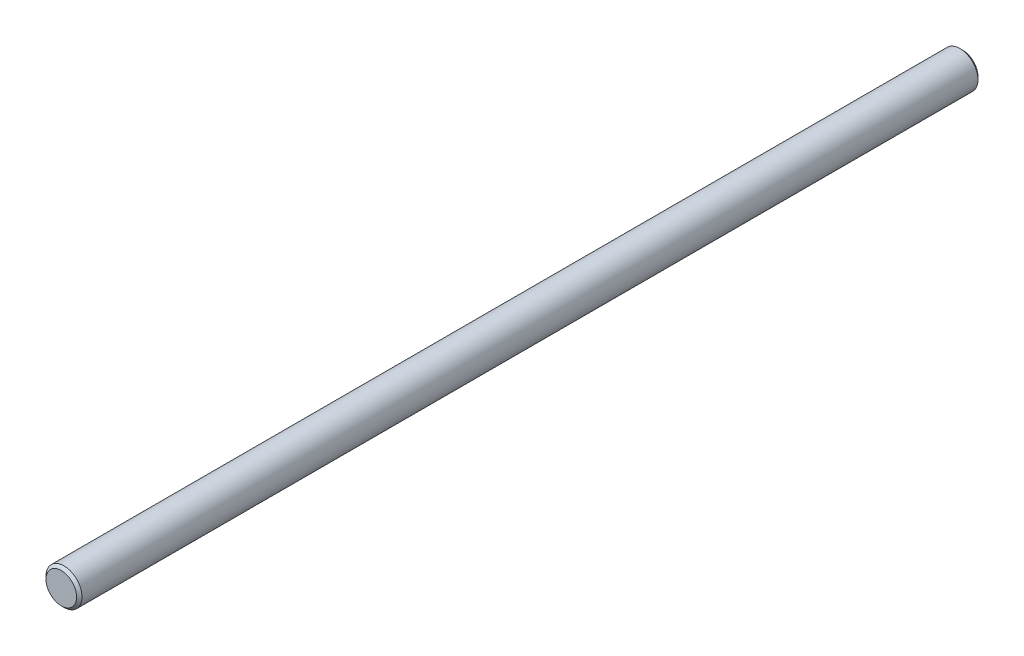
from build123d import *

# Parameters (mm, degrees)
ESQUISSE1_R      = 2
EXTRUSION1_DEPTH = 100
CHANFREIN1_SIZE  = 0.3
CHANFREIN2_SIZE  = 0.3


with BuildPart() as part:
    # Esquisse1 → Extrusion1 (new body)
    with BuildSketch(Plane.XY):
        Circle(ESQUISSE1_R)
    extrude(amount=EXTRUSION1_DEPTH)

    # Chanfrein1
    chanfrein1_edges = [part.edges().sort_by_distance(p)[0] for p in [
        (-2, 0, 100),
    ]]
    chamfer(chanfrein1_edges, length=CHANFREIN1_SIZE)

    # Chanfrein2
    chanfrein2_edges = [part.edges().sort_by_distance(p)[0] for p in [
        (-2, 0, 0),
    ]]
    chamfer(chanfrein2_edges, length=CHANFREIN2_SIZE)


solid = part.part
